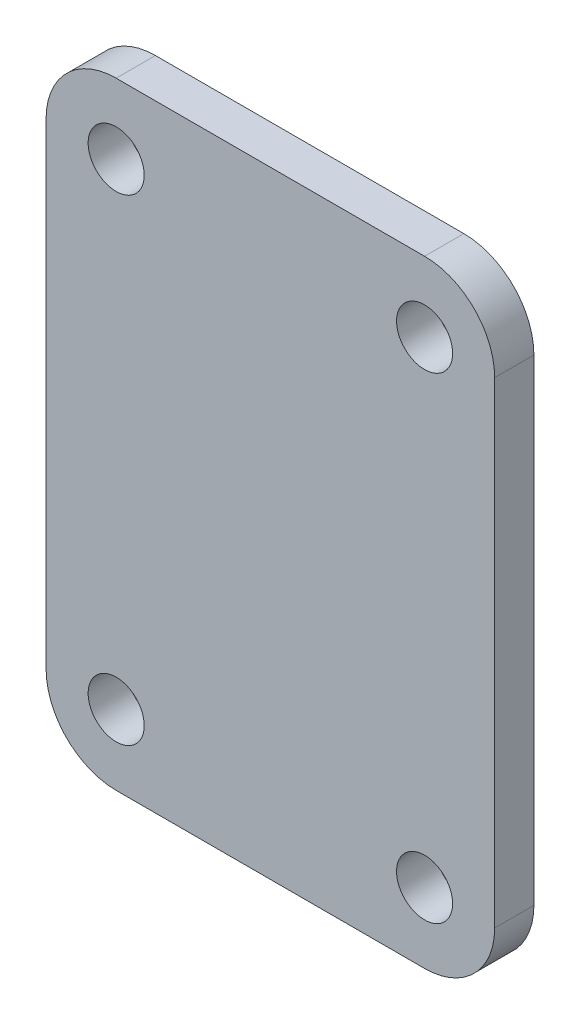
from build123d import *

# Parameters (mm, degrees)
ESQUISSE2_R      = 5
EXTRUSION1_DEPTH = 7


with BuildPart() as part:
    # Esquisse2 → Extrusion1 (new body)
    with BuildSketch(Plane.XY):
        with BuildLine():
            Line((-621, 210), (-566, 210))
            ThreePointArc((-566, 210), (-557.161165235, 206.338834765), (-553.5, 197.5))
            Line((-553.5, 197.5), (-553.5, 112.5))
            ThreePointArc((-553.5, 112.5), (-557.161165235, 103.661165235), (-566, 100))
            Line((-566, 100), (-621, 100))
            ThreePointArc((-621, 100), (-629.838834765, 103.661165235), (-633.5, 112.5))
            Line((-633.5, 112.5), (-633.5, 197.5))
            ThreePointArc((-633.5, 197.5), (-629.838834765, 206.338834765), (-621, 210))
        make_face()
        with Locations((-621, 197.5)):
            Circle(ESQUISSE2_R, mode=Mode.SUBTRACT)
        with Locations((-566, 197.5)):
            Circle(ESQUISSE2_R, mode=Mode.SUBTRACT)
        with Locations((-566, 112.5)):
            Circle(ESQUISSE2_R, mode=Mode.SUBTRACT)
        with Locations((-621, 112.5)):
            Circle(ESQUISSE2_R, mode=Mode.SUBTRACT)
    extrude(amount=EXTRUSION1_DEPTH)


solid = part.part
